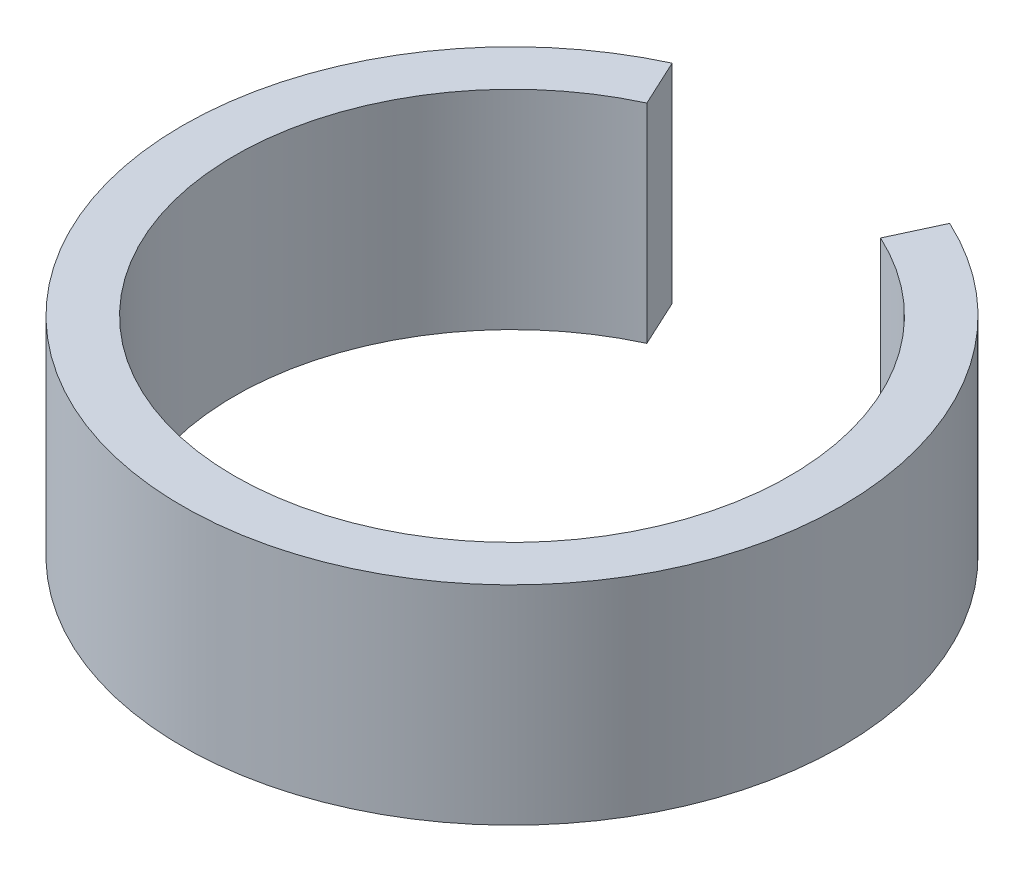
ISO-10303-21;
HEADER;
FILE_DESCRIPTION(('STEP AP214'),'2;1');
FILE_NAME('part.step','',(''),(''),'','','');
FILE_SCHEMA(('AUTOMOTIVE_DESIGN { 1 0 10303 214 1 1 1 1 }'));
ENDSEC;
DATA;
#1=APPLICATION_CONTEXT('core data for automotive mechanical design processes');
#2=APPLICATION_PROTOCOL_DEFINITION('international standard','automotive_design',2000,#1);
#3=PRODUCT_CONTEXT('',#1,'mechanical');
#4=PRODUCT('Part','Part','',(#3));
#5=PRODUCT_RELATED_PRODUCT_CATEGORY('part','',(#4));
#6=PRODUCT_DEFINITION_FORMATION('','',#4);
#7=PRODUCT_DEFINITION_CONTEXT('part definition',#1,'design');
#8=PRODUCT_DEFINITION('design','',#6,#7);
#9=PRODUCT_DEFINITION_SHAPE('','',#8);
#10=(LENGTH_UNIT() NAMED_UNIT(*) SI_UNIT(.MILLI.,.METRE.));
#11=(NAMED_UNIT(*) PLANE_ANGLE_UNIT() SI_UNIT($,.RADIAN.));
#12=(NAMED_UNIT(*) SI_UNIT($,.STERADIAN.) SOLID_ANGLE_UNIT());
#13=UNCERTAINTY_MEASURE_WITH_UNIT(LENGTH_MEASURE(1.E-05),#10,'distance_accuracy_value','');
#14=(GEOMETRIC_REPRESENTATION_CONTEXT(3) GLOBAL_UNCERTAINTY_ASSIGNED_CONTEXT((#13)) GLOBAL_UNIT_ASSIGNED_CONTEXT((#10,
#11,#12)) REPRESENTATION_CONTEXT('',''));
#15=CARTESIAN_POINT('',(0.,0.,0.));
#16=DIRECTION('',(0.,0.,1.));
#17=DIRECTION('',(1.,0.,0.));
#18=AXIS2_PLACEMENT_3D('',#15,#16,#17);
#19=CARTESIAN_POINT('',(0.,3.,0.));
#20=DIRECTION('',(0.,-1.,0.));
#21=DIRECTION('',(0.,0.,-1.));
#22=AXIS2_PLACEMENT_3D('',#19,#20,#21);
#23=CYLINDRICAL_SURFACE('',#22,4.75);
#24=CARTESIAN_POINT('',(0.,0.,0.));
#25=DIRECTION('',(0.,1.,0.));
#26=DIRECTION('',(0.,0.,1.));
#27=AXIS2_PLACEMENT_3D('',#24,#25,#26);
#28=CIRCLE('',#27,4.75);
#29=CARTESIAN_POINT('',(-2.,0.,-4.30842198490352));
#30=VERTEX_POINT('',#29);
#31=CARTESIAN_POINT('',(2.,0.,-4.30842198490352));
#32=VERTEX_POINT('',#31);
#33=EDGE_CURVE('E96',#30,#32,#28,.T.);
#34=ORIENTED_EDGE('',*,*,#33,.T.);
#35=DIRECTION('',(0.,-1.,0.));
#36=VECTOR('',#35,1.);
#37=CARTESIAN_POINT('',(2.,3.,-4.30842198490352));
#38=LINE('',#37,#36);
#39=CARTESIAN_POINT('',(2.,3.,-4.30842198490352));
#40=VERTEX_POINT('',#39);
#41=EDGE_CURVE('E11',#40,#32,#38,.T.);
#42=ORIENTED_EDGE('',*,*,#41,.F.);
#43=CARTESIAN_POINT('',(0.,3.,0.));
#44=DIRECTION('',(0.,1.,0.));
#45=DIRECTION('',(0.,0.,1.));
#46=AXIS2_PLACEMENT_3D('',#43,#44,#45);
#47=CIRCLE('',#46,4.75);
#48=CARTESIAN_POINT('',(-2.,3.,-4.30842198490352));
#49=VERTEX_POINT('',#48);
#50=EDGE_CURVE('E84',#49,#40,#47,.T.);
#51=ORIENTED_EDGE('',*,*,#50,.F.);
#52=DIRECTION('',(0.,-1.,0.));
#53=VECTOR('',#52,1.);
#54=CARTESIAN_POINT('',(-2.,3.,-4.30842198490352));
#55=LINE('',#54,#53);
#56=EDGE_CURVE('E92',#49,#30,#55,.T.);
#57=ORIENTED_EDGE('',*,*,#56,.T.);
#58=EDGE_LOOP('',(#34,#42,#51,#57));
#59=FACE_BOUND('',#58,.T.);
#60=ADVANCED_FACE('F33',(#59),#23,.T.);
#61=CARTESIAN_POINT('',(2.,3.,-4.30842198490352));
#62=DIRECTION('',(0.90703620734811,0.,0.421052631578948));
#63=DIRECTION('',(0.421052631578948,0.,-0.90703620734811));
#64=AXIS2_PLACEMENT_3D('',#61,#62,#63);
#65=PLANE('',#64);
#66=DIRECTION('',(-0.421052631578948,0.,0.90703620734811));
#67=VECTOR('',#66,1.);
#68=CARTESIAN_POINT('',(2.,0.,-4.30842198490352));
#69=LINE('',#68,#67);
#70=CARTESIAN_POINT('',(1.68421052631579,0.,-3.62814482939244));
#71=VERTEX_POINT('',#70);
#72=EDGE_CURVE('E88',#32,#71,#69,.T.);
#73=ORIENTED_EDGE('',*,*,#72,.T.);
#74=DIRECTION('',(0.,-1.,0.));
#75=VECTOR('',#74,1.);
#76=CARTESIAN_POINT('',(1.68421052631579,3.,-3.62814482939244));
#77=LINE('',#76,#75);
#78=CARTESIAN_POINT('',(1.68421052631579,3.,-3.62814482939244));
#79=VERTEX_POINT('',#78);
#80=EDGE_CURVE('E41',#79,#71,#77,.T.);
#81=ORIENTED_EDGE('',*,*,#80,.F.);
#82=DIRECTION('',(-0.421052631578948,0.,0.90703620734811));
#83=VECTOR('',#82,1.);
#84=CARTESIAN_POINT('',(2.,3.,-4.30842198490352));
#85=LINE('',#84,#83);
#86=EDGE_CURVE('E79',#40,#79,#85,.T.);
#87=ORIENTED_EDGE('',*,*,#86,.F.);
#88=ORIENTED_EDGE('',*,*,#41,.T.);
#89=EDGE_LOOP('',(#73,#81,#87,#88));
#90=FACE_BOUND('',#89,.T.);
#91=ADVANCED_FACE('F87',(#90),#65,.F.);
#92=CARTESIAN_POINT('',(0.,3.,0.));
#93=DIRECTION('',(0.,-1.,0.));
#94=DIRECTION('',(0.,0.,-1.));
#95=AXIS2_PLACEMENT_3D('',#92,#93,#94);
#96=CYLINDRICAL_SURFACE('',#95,4.);
#97=CARTESIAN_POINT('',(0.,0.,0.));
#98=DIRECTION('',(0.,-1.,0.));
#99=DIRECTION('',(0.,0.,1.));
#100=AXIS2_PLACEMENT_3D('',#97,#98,#99);
#101=CIRCLE('',#100,4.);
#102=CARTESIAN_POINT('',(-1.68421052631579,0.,-3.62814482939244));
#103=VERTEX_POINT('',#102);
#104=EDGE_CURVE('E66',#71,#103,#101,.T.);
#105=ORIENTED_EDGE('',*,*,#104,.T.);
#106=DIRECTION('',(0.,-1.,0.));
#107=VECTOR('',#106,1.);
#108=CARTESIAN_POINT('',(-1.68421052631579,3.,-3.62814482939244));
#109=LINE('',#108,#107);
#110=CARTESIAN_POINT('',(-1.68421052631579,3.,-3.62814482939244));
#111=VERTEX_POINT('',#110);
#112=EDGE_CURVE('E89',#111,#103,#109,.T.);
#113=ORIENTED_EDGE('',*,*,#112,.F.);
#114=CARTESIAN_POINT('',(0.,3.,0.));
#115=DIRECTION('',(0.,-1.,0.));
#116=DIRECTION('',(0.,0.,1.));
#117=AXIS2_PLACEMENT_3D('',#114,#115,#116);
#118=CIRCLE('',#117,4.);
#119=EDGE_CURVE('E82',#79,#111,#118,.T.);
#120=ORIENTED_EDGE('',*,*,#119,.F.);
#121=ORIENTED_EDGE('',*,*,#80,.T.);
#122=EDGE_LOOP('',(#105,#113,#120,#121));
#123=FACE_BOUND('',#122,.T.);
#124=ADVANCED_FACE('F90',(#123),#96,.F.);
#125=CARTESIAN_POINT('',(-2.,3.,-4.30842198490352));
#126=DIRECTION('',(-0.90703620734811,0.,0.421052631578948));
#127=DIRECTION('',(0.421052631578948,0.,0.90703620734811));
#128=AXIS2_PLACEMENT_3D('',#125,#126,#127);
#129=PLANE('',#128);
#130=DIRECTION('',(-0.421052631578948,0.,-0.90703620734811));
#131=VECTOR('',#130,1.);
#132=CARTESIAN_POINT('',(-2.,0.,-4.30842198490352));
#133=LINE('',#132,#131);
#134=EDGE_CURVE('E72',#103,#30,#133,.T.);
#135=ORIENTED_EDGE('',*,*,#134,.T.);
#136=ORIENTED_EDGE('',*,*,#56,.F.);
#137=DIRECTION('',(-0.421052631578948,0.,-0.90703620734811));
#138=VECTOR('',#137,1.);
#139=CARTESIAN_POINT('',(-2.,3.,-4.30842198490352));
#140=LINE('',#139,#138);
#141=EDGE_CURVE('E49',#111,#49,#140,.T.);
#142=ORIENTED_EDGE('',*,*,#141,.F.);
#143=ORIENTED_EDGE('',*,*,#112,.T.);
#144=EDGE_LOOP('',(#135,#136,#142,#143));
#145=FACE_BOUND('',#144,.T.);
#146=ADVANCED_FACE('F103',(#145),#129,.F.);
#147=CARTESIAN_POINT('',(0.,3.,0.));
#148=DIRECTION('',(0.,1.,0.));
#149=DIRECTION('',(0.,0.,1.));
#150=AXIS2_PLACEMENT_3D('',#147,#148,#149);
#151=PLANE('',#150);
#152=ORIENTED_EDGE('',*,*,#50,.T.);
#153=ORIENTED_EDGE('',*,*,#86,.T.);
#154=ORIENTED_EDGE('',*,*,#119,.T.);
#155=ORIENTED_EDGE('',*,*,#141,.T.);
#156=EDGE_LOOP('',(#152,#153,#154,#155));
#157=FACE_BOUND('',#156,.T.);
#158=ADVANCED_FACE('F80',(#157),#151,.T.);
#159=CARTESIAN_POINT('',(0.,0.,0.));
#160=DIRECTION('',(0.,1.,0.));
#161=DIRECTION('',(0.,0.,1.));
#162=AXIS2_PLACEMENT_3D('',#159,#160,#161);
#163=PLANE('',#162);
#164=ORIENTED_EDGE('',*,*,#33,.F.);
#165=ORIENTED_EDGE('',*,*,#134,.F.);
#166=ORIENTED_EDGE('',*,*,#104,.F.);
#167=ORIENTED_EDGE('',*,*,#72,.F.);
#168=EDGE_LOOP('',(#164,#165,#166,#167));
#169=FACE_BOUND('',#168,.T.);
#170=ADVANCED_FACE('F106',(#169),#163,.F.);
#171=CLOSED_SHELL('',(#60,#91,#124,#146,#158,#170));
#172=MANIFOLD_SOLID_BREP('B2',#171);
#173=ADVANCED_BREP_SHAPE_REPRESENTATION('',(#18,#172),#14);
#174=SHAPE_DEFINITION_REPRESENTATION(#9,#173);
ENDSEC;
END-ISO-10303-21;
